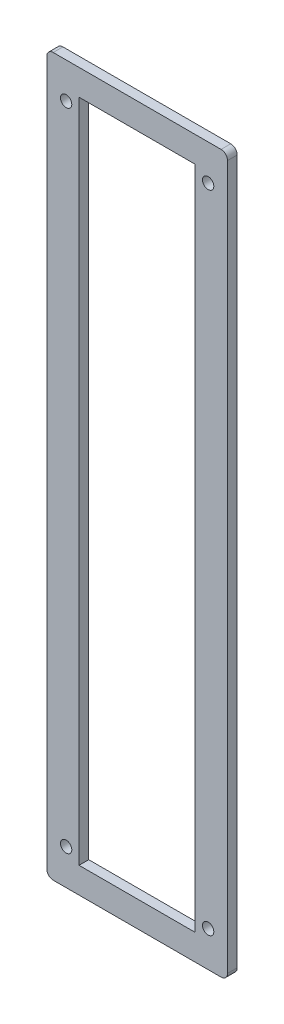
ISO-10303-21;
HEADER;
FILE_DESCRIPTION(('STEP AP214'),'2;1');
FILE_NAME('part.step','',(''),(''),'','','');
FILE_SCHEMA(('AUTOMOTIVE_DESIGN { 1 0 10303 214 1 1 1 1 }'));
ENDSEC;
DATA;
#1=APPLICATION_CONTEXT('core data for automotive mechanical design processes');
#2=APPLICATION_PROTOCOL_DEFINITION('international standard','automotive_design',2000,#1);
#3=PRODUCT_CONTEXT('',#1,'mechanical');
#4=PRODUCT('Part','Part','',(#3));
#5=PRODUCT_RELATED_PRODUCT_CATEGORY('part','',(#4));
#6=PRODUCT_DEFINITION_FORMATION('','',#4);
#7=PRODUCT_DEFINITION_CONTEXT('part definition',#1,'design');
#8=PRODUCT_DEFINITION('design','',#6,#7);
#9=PRODUCT_DEFINITION_SHAPE('','',#8);
#10=(LENGTH_UNIT() NAMED_UNIT(*) SI_UNIT(.MILLI.,.METRE.));
#11=(NAMED_UNIT(*) PLANE_ANGLE_UNIT() SI_UNIT($,.RADIAN.));
#12=(NAMED_UNIT(*) SI_UNIT($,.STERADIAN.) SOLID_ANGLE_UNIT());
#13=UNCERTAINTY_MEASURE_WITH_UNIT(LENGTH_MEASURE(1.E-05),#10,'distance_accuracy_value','');
#14=(GEOMETRIC_REPRESENTATION_CONTEXT(3) GLOBAL_UNCERTAINTY_ASSIGNED_CONTEXT((#13)) GLOBAL_UNIT_ASSIGNED_CONTEXT((#10,
#11,#12)) REPRESENTATION_CONTEXT('',''));
#15=CARTESIAN_POINT('',(0.,0.,0.));
#16=DIRECTION('',(0.,0.,1.));
#17=DIRECTION('',(1.,0.,0.));
#18=AXIS2_PLACEMENT_3D('',#15,#16,#17);
#19=CARTESIAN_POINT('',(-44.4440386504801,176.276,4.7752));
#20=DIRECTION('',(1.,0.,0.));
#21=DIRECTION('',(0.,1.,0.));
#22=AXIS2_PLACEMENT_3D('',#19,#20,#21);
#23=PLANE('',#22);
#24=DIRECTION('',(0.,-1.,0.));
#25=VECTOR('',#24,1.);
#26=CARTESIAN_POINT('',(-44.4440386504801,176.276,0.));
#27=LINE('',#26,#25);
#28=CARTESIAN_POINT('',(-44.4440386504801,173.101,0.));
#29=VERTEX_POINT('',#28);
#30=CARTESIAN_POINT('',(-44.4440386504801,-173.101,0.));
#31=VERTEX_POINT('',#30);
#32=EDGE_CURVE('E164',#29,#31,#27,.T.);
#33=ORIENTED_EDGE('',*,*,#32,.T.);
#34=DIRECTION('',(0.,0.,-1.));
#35=VECTOR('',#34,1.);
#36=CARTESIAN_POINT('',(-44.4440386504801,-173.101,4.7752));
#37=LINE('',#36,#35);
#38=CARTESIAN_POINT('',(-44.4440386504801,-173.101,4.7752));
#39=VERTEX_POINT('',#38);
#40=EDGE_CURVE('E216',#31,#39,#37,.F.);
#41=ORIENTED_EDGE('',*,*,#40,.T.);
#42=DIRECTION('',(0.,-1.,0.));
#43=VECTOR('',#42,1.);
#44=CARTESIAN_POINT('',(-44.4440386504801,176.276,4.7752));
#45=LINE('',#44,#43);
#46=CARTESIAN_POINT('',(-44.4440386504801,173.101,4.7752));
#47=VERTEX_POINT('',#46);
#48=EDGE_CURVE('E168',#47,#39,#45,.T.);
#49=ORIENTED_EDGE('',*,*,#48,.F.);
#50=DIRECTION('',(0.,0.,-1.));
#51=VECTOR('',#50,1.);
#52=CARTESIAN_POINT('',(-44.4440386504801,173.101,4.7752));
#53=LINE('',#52,#51);
#54=EDGE_CURVE('E213',#47,#29,#53,.T.);
#55=ORIENTED_EDGE('',*,*,#54,.T.);
#56=EDGE_LOOP('',(#33,#41,#49,#55));
#57=FACE_BOUND('',#56,.T.);
#58=ADVANCED_FACE('F32',(#57),#23,.F.);
#59=CARTESIAN_POINT('',(-44.4440386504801,-176.276,4.7752));
#60=DIRECTION('',(0.,1.,0.));
#61=DIRECTION('',(0.,0.,1.));
#62=AXIS2_PLACEMENT_3D('',#59,#60,#61);
#63=PLANE('',#62);
#64=DIRECTION('',(1.,0.,0.));
#65=VECTOR('',#64,1.);
#66=CARTESIAN_POINT('',(-44.4440386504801,-176.276,0.));
#67=LINE('',#66,#65);
#68=CARTESIAN_POINT('',(-41.2690386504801,-176.276,0.));
#69=VERTEX_POINT('',#68);
#70=CARTESIAN_POINT('',(41.2809613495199,-176.276,0.));
#71=VERTEX_POINT('',#70);
#72=EDGE_CURVE('E182',#69,#71,#67,.T.);
#73=ORIENTED_EDGE('',*,*,#72,.T.);
#74=DIRECTION('',(0.,0.,-1.));
#75=VECTOR('',#74,1.);
#76=CARTESIAN_POINT('',(41.2809613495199,-176.276,4.7752));
#77=LINE('',#76,#75);
#78=CARTESIAN_POINT('',(41.2809613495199,-176.276,4.7752));
#79=VERTEX_POINT('',#78);
#80=EDGE_CURVE('E204',#71,#79,#77,.F.);
#81=ORIENTED_EDGE('',*,*,#80,.T.);
#82=DIRECTION('',(1.,0.,0.));
#83=VECTOR('',#82,1.);
#84=CARTESIAN_POINT('',(-44.4440386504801,-176.276,4.7752));
#85=LINE('',#84,#83);
#86=CARTESIAN_POINT('',(-41.2690386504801,-176.276,4.7752));
#87=VERTEX_POINT('',#86);
#88=EDGE_CURVE('E171',#87,#79,#85,.T.);
#89=ORIENTED_EDGE('',*,*,#88,.F.);
#90=DIRECTION('',(0.,0.,-1.));
#91=VECTOR('',#90,1.);
#92=CARTESIAN_POINT('',(-41.2690386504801,-176.276,4.7752));
#93=LINE('',#92,#91);
#94=EDGE_CURVE('E201',#87,#69,#93,.T.);
#95=ORIENTED_EDGE('',*,*,#94,.T.);
#96=EDGE_LOOP('',(#73,#81,#89,#95));
#97=FACE_BOUND('',#96,.T.);
#98=ADVANCED_FACE('F239',(#97),#63,.F.);
#99=CARTESIAN_POINT('',(44.4559613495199,176.276,4.7752));
#100=DIRECTION('',(-1.,0.,0.));
#101=DIRECTION('',(0.,0.,1.));
#102=AXIS2_PLACEMENT_3D('',#99,#100,#101);
#103=PLANE('',#102);
#104=DIRECTION('',(0.,1.,0.));
#105=VECTOR('',#104,1.);
#106=CARTESIAN_POINT('',(44.4559613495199,176.276,4.7752));
#107=LINE('',#106,#105);
#108=CARTESIAN_POINT('',(44.4559613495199,-173.101,4.7752));
#109=VERTEX_POINT('',#108);
#110=CARTESIAN_POINT('',(44.4559613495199,173.101,4.7752));
#111=VERTEX_POINT('',#110);
#112=EDGE_CURVE('E175',#109,#111,#107,.T.);
#113=ORIENTED_EDGE('',*,*,#112,.F.);
#114=DIRECTION('',(0.,0.,-1.));
#115=VECTOR('',#114,1.);
#116=CARTESIAN_POINT('',(44.4559613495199,-173.101,4.7752));
#117=LINE('',#116,#115);
#118=CARTESIAN_POINT('',(44.4559613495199,-173.101,0.));
#119=VERTEX_POINT('',#118);
#120=EDGE_CURVE('E190',#109,#119,#117,.T.);
#121=ORIENTED_EDGE('',*,*,#120,.T.);
#122=DIRECTION('',(0.,1.,0.));
#123=VECTOR('',#122,1.);
#124=CARTESIAN_POINT('',(44.4559613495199,176.276,0.));
#125=LINE('',#124,#123);
#126=CARTESIAN_POINT('',(44.4559613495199,173.101,0.));
#127=VERTEX_POINT('',#126);
#128=EDGE_CURVE('E185',#119,#127,#125,.T.);
#129=ORIENTED_EDGE('',*,*,#128,.T.);
#130=DIRECTION('',(0.,0.,-1.));
#131=VECTOR('',#130,1.);
#132=CARTESIAN_POINT('',(44.4559613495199,173.101,4.7752));
#133=LINE('',#132,#131);
#134=EDGE_CURVE('E179',#127,#111,#133,.F.);
#135=ORIENTED_EDGE('',*,*,#134,.T.);
#136=EDGE_LOOP('',(#113,#121,#129,#135));
#137=FACE_BOUND('',#136,.T.);
#138=ADVANCED_FACE('F247',(#137),#103,.F.);
#139=CARTESIAN_POINT('',(-44.4440386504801,176.276,4.7752));
#140=DIRECTION('',(0.,-1.,0.));
#141=DIRECTION('',(0.,0.,-1.));
#142=AXIS2_PLACEMENT_3D('',#139,#140,#141);
#143=PLANE('',#142);
#144=DIRECTION('',(-1.,0.,0.));
#145=VECTOR('',#144,1.);
#146=CARTESIAN_POINT('',(-44.4440386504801,176.276,0.));
#147=LINE('',#146,#145);
#148=CARTESIAN_POINT('',(41.2809613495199,176.276,0.));
#149=VERTEX_POINT('',#148);
#150=CARTESIAN_POINT('',(-41.2690386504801,176.276,0.));
#151=VERTEX_POINT('',#150);
#152=EDGE_CURVE('E172',#149,#151,#147,.T.);
#153=ORIENTED_EDGE('',*,*,#152,.T.);
#154=DIRECTION('',(0.,0.,-1.));
#155=VECTOR('',#154,1.);
#156=CARTESIAN_POINT('',(-41.2690386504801,176.276,4.7752));
#157=LINE('',#156,#155);
#158=CARTESIAN_POINT('',(-41.2690386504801,176.276,4.7752));
#159=VERTEX_POINT('',#158);
#160=EDGE_CURVE('E11',#151,#159,#157,.F.);
#161=ORIENTED_EDGE('',*,*,#160,.T.);
#162=DIRECTION('',(-1.,0.,0.));
#163=VECTOR('',#162,1.);
#164=CARTESIAN_POINT('',(-44.4440386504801,176.276,4.7752));
#165=LINE('',#164,#163);
#166=CARTESIAN_POINT('',(41.2809613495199,176.276,4.7752));
#167=VERTEX_POINT('',#166);
#168=EDGE_CURVE('E177',#167,#159,#165,.T.);
#169=ORIENTED_EDGE('',*,*,#168,.F.);
#170=DIRECTION('',(0.,0.,-1.));
#171=VECTOR('',#170,1.);
#172=CARTESIAN_POINT('',(41.2809613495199,176.276,4.7752));
#173=LINE('',#172,#171);
#174=EDGE_CURVE('E40',#167,#149,#173,.T.);
#175=ORIENTED_EDGE('',*,*,#174,.T.);
#176=EDGE_LOOP('',(#153,#161,#169,#175));
#177=FACE_BOUND('',#176,.T.);
#178=ADVANCED_FACE('F220',(#177),#143,.F.);
#179=CARTESIAN_POINT('',(0.,0.,4.7752));
#180=DIRECTION('',(0.,0.,1.));
#181=DIRECTION('',(1.,0.,0.));
#182=AXIS2_PLACEMENT_3D('',#179,#180,#181);
#183=PLANE('',#182);
#184=CARTESIAN_POINT('',(34.9309613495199,158.75435671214,4.7752));
#185=DIRECTION('',(0.,0.,1.));
#186=DIRECTION('',(1.,0.,0.));
#187=AXIS2_PLACEMENT_3D('',#184,#185,#186);
#188=CIRCLE('',#187,2.778125);
#189=CARTESIAN_POINT('',(37.7090863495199,158.75435671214,4.7752));
#190=VERTEX_POINT('',#189);
#191=EDGE_CURVE('E408',#190,#190,#188,.T.);
#192=ORIENTED_EDGE('',*,*,#191,.F.);
#193=EDGE_LOOP('',(#192));
#194=FACE_BOUND('',#193,.T.);
#195=CARTESIAN_POINT('',(-34.91903865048,158.74182662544,4.7752));
#196=DIRECTION('',(0.,0.,1.));
#197=DIRECTION('',(1.,0.,0.));
#198=AXIS2_PLACEMENT_3D('',#195,#196,#197);
#199=CIRCLE('',#198,2.778125);
#200=CARTESIAN_POINT('',(-32.14091365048,158.74182662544,4.7752));
#201=VERTEX_POINT('',#200);
#202=EDGE_CURVE('E412',#201,#201,#199,.T.);
#203=ORIENTED_EDGE('',*,*,#202,.F.);
#204=EDGE_LOOP('',(#203));
#205=FACE_BOUND('',#204,.T.);
#206=CARTESIAN_POINT('',(34.9309613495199,-158.75817337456,4.7752));
#207=DIRECTION('',(0.,0.,1.));
#208=DIRECTION('',(1.,0.,0.));
#209=AXIS2_PLACEMENT_3D('',#206,#207,#208);
#210=CIRCLE('',#209,2.778125);
#211=CARTESIAN_POINT('',(37.7090863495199,-158.75817337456,4.7752));
#212=VERTEX_POINT('',#211);
#213=EDGE_CURVE('E416',#212,#212,#210,.T.);
#214=ORIENTED_EDGE('',*,*,#213,.F.);
#215=EDGE_LOOP('',(#214));
#216=FACE_BOUND('',#215,.T.);
#217=CARTESIAN_POINT('',(-34.91903865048,-158.75817337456,4.7752));
#218=DIRECTION('',(0.,0.,1.));
#219=DIRECTION('',(1.,0.,0.));
#220=AXIS2_PLACEMENT_3D('',#217,#218,#219);
#221=CIRCLE('',#220,2.778125);
#222=CARTESIAN_POINT('',(-32.14091365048,-158.75817337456,4.7752));
#223=VERTEX_POINT('',#222);
#224=EDGE_CURVE('E420',#223,#223,#221,.T.);
#225=ORIENTED_EDGE('',*,*,#224,.F.);
#226=EDGE_LOOP('',(#225));
#227=FACE_BOUND('',#226,.T.);
#228=DIRECTION('',(0.,-1.,0.));
#229=VECTOR('',#228,1.);
#230=CARTESIAN_POINT('',(-28.575,163.576,4.7752));
#231=LINE('',#230,#229);
#232=CARTESIAN_POINT('',(-28.575,163.576,4.7752));
#233=VERTEX_POINT('',#232);
#234=CARTESIAN_POINT('',(-28.575,-163.576,4.7752));
#235=VERTEX_POINT('',#234);
#236=EDGE_CURVE('E128',#233,#235,#231,.T.);
#237=ORIENTED_EDGE('',*,*,#236,.F.);
#238=DIRECTION('',(-1.,0.,0.));
#239=VECTOR('',#238,1.);
#240=CARTESIAN_POINT('',(-28.575,163.576,4.7752));
#241=LINE('',#240,#239);
#242=CARTESIAN_POINT('',(28.575,163.576,4.7752));
#243=VERTEX_POINT('',#242);
#244=EDGE_CURVE('E146',#243,#233,#241,.T.);
#245=ORIENTED_EDGE('',*,*,#244,.F.);
#246=DIRECTION('',(0.,1.,0.));
#247=VECTOR('',#246,1.);
#248=CARTESIAN_POINT('',(28.575,163.576,4.7752));
#249=LINE('',#248,#247);
#250=CARTESIAN_POINT('',(28.575,-163.576,4.7752));
#251=VERTEX_POINT('',#250);
#252=EDGE_CURVE('E149',#251,#243,#249,.T.);
#253=ORIENTED_EDGE('',*,*,#252,.F.);
#254=DIRECTION('',(1.,0.,0.));
#255=VECTOR('',#254,1.);
#256=CARTESIAN_POINT('',(-28.575,-163.576,4.7752));
#257=LINE('',#256,#255);
#258=EDGE_CURVE('E158',#235,#251,#257,.T.);
#259=ORIENTED_EDGE('',*,*,#258,.F.);
#260=EDGE_LOOP('',(#237,#245,#253,#259));
#261=FACE_BOUND('',#260,.T.);
#262=ORIENTED_EDGE('',*,*,#88,.T.);
#263=CARTESIAN_POINT('',(41.2809613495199,-173.101,4.7752));
#264=DIRECTION('',(0.,0.,1.));
#265=DIRECTION('',(1.,0.,0.));
#266=AXIS2_PLACEMENT_3D('',#263,#264,#265);
#267=CIRCLE('',#266,3.175);
#268=EDGE_CURVE('E211',#79,#109,#267,.T.);
#269=ORIENTED_EDGE('',*,*,#268,.T.);
#270=ORIENTED_EDGE('',*,*,#112,.T.);
#271=CARTESIAN_POINT('',(41.2809613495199,173.101,4.7752));
#272=DIRECTION('',(0.,0.,1.));
#273=DIRECTION('',(1.,0.,0.));
#274=AXIS2_PLACEMENT_3D('',#271,#272,#273);
#275=CIRCLE('',#274,3.175);
#276=EDGE_CURVE('E52',#111,#167,#275,.T.);
#277=ORIENTED_EDGE('',*,*,#276,.T.);
#278=ORIENTED_EDGE('',*,*,#168,.T.);
#279=CARTESIAN_POINT('',(-41.2690386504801,173.101,4.7752));
#280=DIRECTION('',(0.,0.,1.));
#281=DIRECTION('',(1.,0.,0.));
#282=AXIS2_PLACEMENT_3D('',#279,#280,#281);
#283=CIRCLE('',#282,3.175);
#284=EDGE_CURVE('E207',#159,#47,#283,.T.);
#285=ORIENTED_EDGE('',*,*,#284,.T.);
#286=ORIENTED_EDGE('',*,*,#48,.T.);
#287=CARTESIAN_POINT('',(-41.2690386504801,-173.101,4.7752));
#288=DIRECTION('',(0.,0.,1.));
#289=DIRECTION('',(1.,0.,0.));
#290=AXIS2_PLACEMENT_3D('',#287,#288,#289);
#291=CIRCLE('',#290,3.175);
#292=EDGE_CURVE('E209',#39,#87,#291,.T.);
#293=ORIENTED_EDGE('',*,*,#292,.T.);
#294=EDGE_LOOP('',(#262,#269,#270,#277,#278,#285,#286,#293));
#295=FACE_BOUND('',#294,.T.);
#296=ADVANCED_FACE('F232',(#194,#205,#216,#227,#261,#295),#183,.T.);
#297=CARTESIAN_POINT('',(0.,0.,0.));
#298=DIRECTION('',(0.,0.,1.));
#299=DIRECTION('',(1.,0.,0.));
#300=AXIS2_PLACEMENT_3D('',#297,#298,#299);
#301=PLANE('',#300);
#302=CARTESIAN_POINT('',(34.9309613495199,158.75435671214,0.));
#303=DIRECTION('',(0.,0.,1.));
#304=DIRECTION('',(1.,0.,0.));
#305=AXIS2_PLACEMENT_3D('',#302,#303,#304);
#306=CIRCLE('',#305,2.778125);
#307=CARTESIAN_POINT('',(37.7090863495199,158.75435671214,0.));
#308=VERTEX_POINT('',#307);
#309=EDGE_CURVE('E434',#308,#308,#306,.T.);
#310=ORIENTED_EDGE('',*,*,#309,.T.);
#311=EDGE_LOOP('',(#310));
#312=FACE_BOUND('',#311,.T.);
#313=CARTESIAN_POINT('',(-34.91903865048,158.74182662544,0.));
#314=DIRECTION('',(0.,0.,1.));
#315=DIRECTION('',(1.,0.,0.));
#316=AXIS2_PLACEMENT_3D('',#313,#314,#315);
#317=CIRCLE('',#316,2.778125);
#318=CARTESIAN_POINT('',(-32.14091365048,158.74182662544,0.));
#319=VERTEX_POINT('',#318);
#320=EDGE_CURVE('E430',#319,#319,#317,.T.);
#321=ORIENTED_EDGE('',*,*,#320,.T.);
#322=EDGE_LOOP('',(#321));
#323=FACE_BOUND('',#322,.T.);
#324=CARTESIAN_POINT('',(34.9309613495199,-158.75817337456,0.));
#325=DIRECTION('',(0.,0.,1.));
#326=DIRECTION('',(1.,0.,0.));
#327=AXIS2_PLACEMENT_3D('',#324,#325,#326);
#328=CIRCLE('',#327,2.778125);
#329=CARTESIAN_POINT('',(37.7090863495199,-158.75817337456,0.));
#330=VERTEX_POINT('',#329);
#331=EDGE_CURVE('E424',#330,#330,#328,.T.);
#332=ORIENTED_EDGE('',*,*,#331,.T.);
#333=EDGE_LOOP('',(#332));
#334=FACE_BOUND('',#333,.T.);
#335=CARTESIAN_POINT('',(-34.91903865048,-158.75817337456,0.));
#336=DIRECTION('',(0.,0.,1.));
#337=DIRECTION('',(1.,0.,0.));
#338=AXIS2_PLACEMENT_3D('',#335,#336,#337);
#339=CIRCLE('',#338,2.778125);
#340=CARTESIAN_POINT('',(-32.14091365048,-158.75817337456,0.));
#341=VERTEX_POINT('',#340);
#342=EDGE_CURVE('E152',#341,#341,#339,.T.);
#343=ORIENTED_EDGE('',*,*,#342,.T.);
#344=EDGE_LOOP('',(#343));
#345=FACE_BOUND('',#344,.T.);
#346=DIRECTION('',(-1.,0.,0.));
#347=VECTOR('',#346,1.);
#348=CARTESIAN_POINT('',(-28.575,163.576,0.));
#349=LINE('',#348,#347);
#350=CARTESIAN_POINT('',(28.575,163.576,0.));
#351=VERTEX_POINT('',#350);
#352=CARTESIAN_POINT('',(-28.575,163.576,0.));
#353=VERTEX_POINT('',#352);
#354=EDGE_CURVE('E133',#351,#353,#349,.T.);
#355=ORIENTED_EDGE('',*,*,#354,.T.);
#356=DIRECTION('',(0.,-1.,0.));
#357=VECTOR('',#356,1.);
#358=CARTESIAN_POINT('',(-28.575,163.576,0.));
#359=LINE('',#358,#357);
#360=CARTESIAN_POINT('',(-28.575,-163.576,0.));
#361=VERTEX_POINT('',#360);
#362=EDGE_CURVE('E125',#353,#361,#359,.T.);
#363=ORIENTED_EDGE('',*,*,#362,.T.);
#364=DIRECTION('',(1.,0.,0.));
#365=VECTOR('',#364,1.);
#366=CARTESIAN_POINT('',(-28.575,-163.576,0.));
#367=LINE('',#366,#365);
#368=CARTESIAN_POINT('',(28.575,-163.576,0.));
#369=VERTEX_POINT('',#368);
#370=EDGE_CURVE('E137',#361,#369,#367,.T.);
#371=ORIENTED_EDGE('',*,*,#370,.T.);
#372=DIRECTION('',(0.,1.,0.));
#373=VECTOR('',#372,1.);
#374=CARTESIAN_POINT('',(28.575,163.576,0.));
#375=LINE('',#374,#373);
#376=EDGE_CURVE('E141',#369,#351,#375,.T.);
#377=ORIENTED_EDGE('',*,*,#376,.T.);
#378=EDGE_LOOP('',(#355,#363,#371,#377));
#379=FACE_BOUND('',#378,.T.);
#380=ORIENTED_EDGE('',*,*,#128,.F.);
#381=CARTESIAN_POINT('',(41.2809613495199,-173.101,0.));
#382=DIRECTION('',(0.,0.,1.));
#383=DIRECTION('',(1.,0.,0.));
#384=AXIS2_PLACEMENT_3D('',#381,#382,#383);
#385=CIRCLE('',#384,3.175);
#386=EDGE_CURVE('E199',#119,#71,#385,.F.);
#387=ORIENTED_EDGE('',*,*,#386,.T.);
#388=ORIENTED_EDGE('',*,*,#72,.F.);
#389=CARTESIAN_POINT('',(-41.2690386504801,-173.101,0.));
#390=DIRECTION('',(0.,0.,1.));
#391=DIRECTION('',(1.,0.,0.));
#392=AXIS2_PLACEMENT_3D('',#389,#390,#391);
#393=CIRCLE('',#392,3.175);
#394=EDGE_CURVE('E197',#69,#31,#393,.F.);
#395=ORIENTED_EDGE('',*,*,#394,.T.);
#396=ORIENTED_EDGE('',*,*,#32,.F.);
#397=CARTESIAN_POINT('',(-41.2690386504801,173.101,0.));
#398=DIRECTION('',(0.,0.,1.));
#399=DIRECTION('',(1.,0.,0.));
#400=AXIS2_PLACEMENT_3D('',#397,#398,#399);
#401=CIRCLE('',#400,3.175);
#402=EDGE_CURVE('E195',#29,#151,#401,.F.);
#403=ORIENTED_EDGE('',*,*,#402,.T.);
#404=ORIENTED_EDGE('',*,*,#152,.F.);
#405=CARTESIAN_POINT('',(41.2809613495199,173.101,0.));
#406=DIRECTION('',(0.,0.,1.));
#407=DIRECTION('',(1.,0.,0.));
#408=AXIS2_PLACEMENT_3D('',#405,#406,#407);
#409=CIRCLE('',#408,3.175);
#410=EDGE_CURVE('E193',#149,#127,#409,.F.);
#411=ORIENTED_EDGE('',*,*,#410,.T.);
#412=EDGE_LOOP('',(#380,#387,#388,#395,#396,#403,#404,#411));
#413=FACE_BOUND('',#412,.T.);
#414=ADVANCED_FACE('F143',(#312,#323,#334,#345,#379,#413),#301,.F.);
#415=CARTESIAN_POINT('',(-28.575,163.576,0.));
#416=DIRECTION('',(-1.,0.,0.));
#417=DIRECTION('',(0.,0.,1.));
#418=AXIS2_PLACEMENT_3D('',#415,#416,#417);
#419=PLANE('',#418);
#420=ORIENTED_EDGE('',*,*,#236,.T.);
#421=DIRECTION('',(0.,0.,1.));
#422=VECTOR('',#421,1.);
#423=CARTESIAN_POINT('',(-28.575,-163.576,0.));
#424=LINE('',#423,#422);
#425=EDGE_CURVE('E121',#361,#235,#424,.T.);
#426=ORIENTED_EDGE('',*,*,#425,.F.);
#427=ORIENTED_EDGE('',*,*,#362,.F.);
#428=DIRECTION('',(0.,0.,1.));
#429=VECTOR('',#428,1.);
#430=CARTESIAN_POINT('',(-28.575,163.576,0.));
#431=LINE('',#430,#429);
#432=EDGE_CURVE('E162',#353,#233,#431,.T.);
#433=ORIENTED_EDGE('',*,*,#432,.T.);
#434=EDGE_LOOP('',(#420,#426,#427,#433));
#435=FACE_BOUND('',#434,.T.);
#436=ADVANCED_FACE('F123',(#435),#419,.F.);
#437=CARTESIAN_POINT('',(-28.575,163.576,0.));
#438=DIRECTION('',(0.,1.,0.));
#439=DIRECTION('',(0.,0.,1.));
#440=AXIS2_PLACEMENT_3D('',#437,#438,#439);
#441=PLANE('',#440);
#442=ORIENTED_EDGE('',*,*,#244,.T.);
#443=ORIENTED_EDGE('',*,*,#432,.F.);
#444=ORIENTED_EDGE('',*,*,#354,.F.);
#445=DIRECTION('',(0.,0.,1.));
#446=VECTOR('',#445,1.);
#447=CARTESIAN_POINT('',(28.575,163.576,0.));
#448=LINE('',#447,#446);
#449=EDGE_CURVE('E165',#351,#243,#448,.T.);
#450=ORIENTED_EDGE('',*,*,#449,.T.);
#451=EDGE_LOOP('',(#442,#443,#444,#450));
#452=FACE_BOUND('',#451,.T.);
#453=ADVANCED_FACE('F337',(#452),#441,.F.);
#454=CARTESIAN_POINT('',(28.575,163.576,0.));
#455=DIRECTION('',(1.,0.,0.));
#456=DIRECTION('',(0.,0.,-1.));
#457=AXIS2_PLACEMENT_3D('',#454,#455,#456);
#458=PLANE('',#457);
#459=ORIENTED_EDGE('',*,*,#252,.T.);
#460=ORIENTED_EDGE('',*,*,#449,.F.);
#461=ORIENTED_EDGE('',*,*,#376,.F.);
#462=DIRECTION('',(0.,0.,1.));
#463=VECTOR('',#462,1.);
#464=CARTESIAN_POINT('',(28.575,-163.576,0.));
#465=LINE('',#464,#463);
#466=EDGE_CURVE('E132',#369,#251,#465,.T.);
#467=ORIENTED_EDGE('',*,*,#466,.T.);
#468=EDGE_LOOP('',(#459,#460,#461,#467));
#469=FACE_BOUND('',#468,.T.);
#470=ADVANCED_FACE('F329',(#469),#458,.F.);
#471=CARTESIAN_POINT('',(-28.575,-163.576,0.));
#472=DIRECTION('',(0.,-1.,0.));
#473=DIRECTION('',(0.,0.,-1.));
#474=AXIS2_PLACEMENT_3D('',#471,#472,#473);
#475=PLANE('',#474);
#476=ORIENTED_EDGE('',*,*,#258,.T.);
#477=ORIENTED_EDGE('',*,*,#466,.F.);
#478=ORIENTED_EDGE('',*,*,#370,.F.);
#479=ORIENTED_EDGE('',*,*,#425,.T.);
#480=EDGE_LOOP('',(#476,#477,#478,#479));
#481=FACE_BOUND('',#480,.T.);
#482=ADVANCED_FACE('F138',(#481),#475,.F.);
#483=CARTESIAN_POINT('',(-34.91903865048,-158.75817337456,4.7752));
#484=DIRECTION('',(0.,0.,1.));
#485=DIRECTION('',(1.,0.,0.));
#486=AXIS2_PLACEMENT_3D('',#483,#484,#485);
#487=CYLINDRICAL_SURFACE('',#486,2.778125);
#488=ORIENTED_EDGE('',*,*,#342,.F.);
#489=EDGE_LOOP('',(#488));
#490=FACE_BOUND('',#489,.T.);
#491=ORIENTED_EDGE('',*,*,#224,.T.);
#492=EDGE_LOOP('',(#491));
#493=FACE_BOUND('',#492,.T.);
#494=ADVANCED_FACE('F312',(#490,#493),#487,.F.);
#495=CARTESIAN_POINT('',(34.9309613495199,-158.75817337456,4.7752));
#496=DIRECTION('',(0.,0.,1.));
#497=DIRECTION('',(1.,0.,0.));
#498=AXIS2_PLACEMENT_3D('',#495,#496,#497);
#499=CYLINDRICAL_SURFACE('',#498,2.778125);
#500=ORIENTED_EDGE('',*,*,#331,.F.);
#501=EDGE_LOOP('',(#500));
#502=FACE_BOUND('',#501,.T.);
#503=ORIENTED_EDGE('',*,*,#213,.T.);
#504=EDGE_LOOP('',(#503));
#505=FACE_BOUND('',#504,.T.);
#506=ADVANCED_FACE('F303',(#502,#505),#499,.F.);
#507=CARTESIAN_POINT('',(-34.91903865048,158.74182662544,4.7752));
#508=DIRECTION('',(0.,0.,1.));
#509=DIRECTION('',(1.,0.,0.));
#510=AXIS2_PLACEMENT_3D('',#507,#508,#509);
#511=CYLINDRICAL_SURFACE('',#510,2.778125);
#512=ORIENTED_EDGE('',*,*,#320,.F.);
#513=EDGE_LOOP('',(#512));
#514=FACE_BOUND('',#513,.T.);
#515=ORIENTED_EDGE('',*,*,#202,.T.);
#516=EDGE_LOOP('',(#515));
#517=FACE_BOUND('',#516,.T.);
#518=ADVANCED_FACE('F294',(#514,#517),#511,.F.);
#519=CARTESIAN_POINT('',(34.9309613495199,158.75435671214,4.7752));
#520=DIRECTION('',(0.,0.,1.));
#521=DIRECTION('',(1.,0.,0.));
#522=AXIS2_PLACEMENT_3D('',#519,#520,#521);
#523=CYLINDRICAL_SURFACE('',#522,2.778125);
#524=ORIENTED_EDGE('',*,*,#309,.F.);
#525=EDGE_LOOP('',(#524));
#526=FACE_BOUND('',#525,.T.);
#527=ORIENTED_EDGE('',*,*,#191,.T.);
#528=EDGE_LOOP('',(#527));
#529=FACE_BOUND('',#528,.T.);
#530=ADVANCED_FACE('F263',(#526,#529),#523,.F.);
#531=CARTESIAN_POINT('',(41.2809613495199,-173.101,4.7752));
#532=DIRECTION('',(0.,0.,-1.));
#533=DIRECTION('',(-1.,0.,0.));
#534=AXIS2_PLACEMENT_3D('',#531,#532,#533);
#535=CYLINDRICAL_SURFACE('',#534,3.175);
#536=ORIENTED_EDGE('',*,*,#268,.F.);
#537=ORIENTED_EDGE('',*,*,#80,.F.);
#538=ORIENTED_EDGE('',*,*,#386,.F.);
#539=ORIENTED_EDGE('',*,*,#120,.F.);
#540=EDGE_LOOP('',(#536,#537,#538,#539));
#541=FACE_BOUND('',#540,.T.);
#542=ADVANCED_FACE('F244',(#541),#535,.T.);
#543=CARTESIAN_POINT('',(-41.2690386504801,-173.101,4.7752));
#544=DIRECTION('',(0.,0.,-1.));
#545=DIRECTION('',(-1.,0.,0.));
#546=AXIS2_PLACEMENT_3D('',#543,#544,#545);
#547=CYLINDRICAL_SURFACE('',#546,3.175);
#548=ORIENTED_EDGE('',*,*,#292,.F.);
#549=ORIENTED_EDGE('',*,*,#40,.F.);
#550=ORIENTED_EDGE('',*,*,#394,.F.);
#551=ORIENTED_EDGE('',*,*,#94,.F.);
#552=EDGE_LOOP('',(#548,#549,#550,#551));
#553=FACE_BOUND('',#552,.T.);
#554=ADVANCED_FACE('F236',(#553),#547,.T.);
#555=CARTESIAN_POINT('',(-41.2690386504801,173.101,4.7752));
#556=DIRECTION('',(0.,0.,-1.));
#557=DIRECTION('',(-1.,0.,0.));
#558=AXIS2_PLACEMENT_3D('',#555,#556,#557);
#559=CYLINDRICAL_SURFACE('',#558,3.175);
#560=ORIENTED_EDGE('',*,*,#284,.F.);
#561=ORIENTED_EDGE('',*,*,#160,.F.);
#562=ORIENTED_EDGE('',*,*,#402,.F.);
#563=ORIENTED_EDGE('',*,*,#54,.F.);
#564=EDGE_LOOP('',(#560,#561,#562,#563));
#565=FACE_BOUND('',#564,.T.);
#566=ADVANCED_FACE('F227',(#565),#559,.T.);
#567=CARTESIAN_POINT('',(41.2809613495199,173.101,4.7752));
#568=DIRECTION('',(0.,0.,-1.));
#569=DIRECTION('',(-1.,0.,0.));
#570=AXIS2_PLACEMENT_3D('',#567,#568,#569);
#571=CYLINDRICAL_SURFACE('',#570,3.175);
#572=ORIENTED_EDGE('',*,*,#276,.F.);
#573=ORIENTED_EDGE('',*,*,#134,.F.);
#574=ORIENTED_EDGE('',*,*,#410,.F.);
#575=ORIENTED_EDGE('',*,*,#174,.F.);
#576=EDGE_LOOP('',(#572,#573,#574,#575));
#577=FACE_BOUND('',#576,.T.);
#578=ADVANCED_FACE('F34',(#577),#571,.T.);
#579=CLOSED_SHELL('',(#58,#98,#138,#178,#296,#414,#436,#453,#470,#482,#494,#506,#518,#530,#542,
#554,#566,#578));
#580=MANIFOLD_SOLID_BREP('B2',#579);
#581=ADVANCED_BREP_SHAPE_REPRESENTATION('',(#18,#580),#14);
#582=SHAPE_DEFINITION_REPRESENTATION(#9,#581);
ENDSEC;
END-ISO-10303-21;
